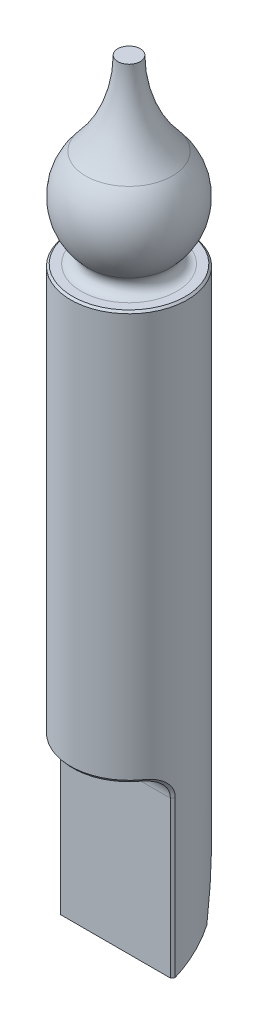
ISO-10303-21;
HEADER;
FILE_DESCRIPTION(('STEP AP214'),'2;1');
FILE_NAME('part.step','',(''),(''),'','','');
FILE_SCHEMA(('AUTOMOTIVE_DESIGN { 1 0 10303 214 1 1 1 1 }'));
ENDSEC;
DATA;
#1=APPLICATION_CONTEXT('core data for automotive mechanical design processes');
#2=APPLICATION_PROTOCOL_DEFINITION('international standard','automotive_design',2000,#1);
#3=PRODUCT_CONTEXT('',#1,'mechanical');
#4=PRODUCT('Part','Part','',(#3));
#5=PRODUCT_RELATED_PRODUCT_CATEGORY('part','',(#4));
#6=PRODUCT_DEFINITION_FORMATION('','',#4);
#7=PRODUCT_DEFINITION_CONTEXT('part definition',#1,'design');
#8=PRODUCT_DEFINITION('design','',#6,#7);
#9=PRODUCT_DEFINITION_SHAPE('','',#8);
#10=(LENGTH_UNIT() NAMED_UNIT(*) SI_UNIT(.MILLI.,.METRE.));
#11=(NAMED_UNIT(*) PLANE_ANGLE_UNIT() SI_UNIT($,.RADIAN.));
#12=(NAMED_UNIT(*) SI_UNIT($,.STERADIAN.) SOLID_ANGLE_UNIT());
#13=UNCERTAINTY_MEASURE_WITH_UNIT(LENGTH_MEASURE(1.E-05),#10,'distance_accuracy_value','');
#14=(GEOMETRIC_REPRESENTATION_CONTEXT(3) GLOBAL_UNCERTAINTY_ASSIGNED_CONTEXT((#13)) GLOBAL_UNIT_ASSIGNED_CONTEXT((#10,
#11,#12)) REPRESENTATION_CONTEXT('',''));
#15=CARTESIAN_POINT('',(0.,0.,0.));
#16=DIRECTION('',(0.,0.,1.));
#17=DIRECTION('',(1.,0.,0.));
#18=AXIS2_PLACEMENT_3D('',#15,#16,#17);
#19=CARTESIAN_POINT('',(-0.575,39.2822667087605,0.));
#20=DIRECTION('',(0.,-1.,0.));
#21=DIRECTION('',(0.,0.,-1.));
#22=AXIS2_PLACEMENT_3D('',#19,#20,#21);
#23=PLANE('',#22);
#24=CARTESIAN_POINT('',(0.,39.2822667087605,0.));
#25=DIRECTION('',(0.,-1.,0.));
#26=DIRECTION('',(0.,0.,-1.));
#27=AXIS2_PLACEMENT_3D('',#24,#25,#26);
#28=CIRCLE('',#27,0.575);
#29=CARTESIAN_POINT('',(0.,39.2822667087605,-0.575));
#30=VERTEX_POINT('',#29);
#31=EDGE_CURVE('E396',#30,#30,#28,.T.);
#32=ORIENTED_EDGE('',*,*,#31,.F.);
#33=EDGE_LOOP('',(#32));
#34=FACE_BOUND('',#33,.T.);
#35=ADVANCED_FACE('F35',(#34),#23,.F.);
#36=CARTESIAN_POINT('',(0.,39.2822667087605,0.));
#37=DIRECTION('',(0.,-1.,0.));
#38=DIRECTION('',(0.,0.,-1.));
#39=AXIS2_PLACEMENT_3D('',#36,#37,#38);
#40=TOROIDAL_SURFACE('',#39,6.925,6.35);
#41=CARTESIAN_POINT('',(0.,35.0157005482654,0.));
#42=DIRECTION('',(0.,-1.,0.));
#43=DIRECTION('',(0.,0.,-1.));
#44=AXIS2_PLACEMENT_3D('',#41,#42,#43);
#45=CIRCLE('',#44,2.22192513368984);
#46=CARTESIAN_POINT('',(-2.22192513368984,35.0157005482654,0.));
#47=VERTEX_POINT('',#46);
#48=EDGE_CURVE('E393',#47,#47,#45,.T.);
#49=ORIENTED_EDGE('',*,*,#48,.F.);
#50=EDGE_LOOP('',(#49));
#51=FACE_BOUND('',#50,.T.);
#52=ORIENTED_EDGE('',*,*,#31,.T.);
#53=EDGE_LOOP('',(#52));
#54=FACE_BOUND('',#53,.T.);
#55=ADVANCED_FACE('F540',(#51,#54),#40,.F.);
#56=CARTESIAN_POINT('',(0.,33.,0.));
#57=DIRECTION('',(0.,-1.,0.));
#58=DIRECTION('',(-1.,0.,0.));
#59=AXIS2_PLACEMENT_3D('',#56,#57,#58);
#60=SPHERICAL_SURFACE('',#59,3.);
#61=CARTESIAN_POINT('',(0.,30.8571428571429,0.));
#62=DIRECTION('',(0.,-1.,0.));
#63=DIRECTION('',(0.,0.,-1.));
#64=AXIS2_PLACEMENT_3D('',#61,#62,#63);
#65=CIRCLE('',#64,2.09956263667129);
#66=CARTESIAN_POINT('',(-2.0995626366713,30.8571428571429,0.));
#67=VERTEX_POINT('',#66);
#68=EDGE_CURVE('E389',#67,#67,#65,.T.);
#69=CARTESIAN_POINT('',(-2.0995626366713,30.8571428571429,0.));
#70=CARTESIAN_POINT('',(-2.1337681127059,30.8906559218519,0.));
#71=CARTESIAN_POINT('',(-2.16716980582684,30.9249892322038,0.));
#72=CARTESIAN_POINT('',(-2.23229208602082,30.9952148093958,0.));
#73=CARTESIAN_POINT('',(-2.26401267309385,31.0311070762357,0.));
#74=CARTESIAN_POINT('',(-2.32569920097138,31.1043690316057,0.));
#75=CARTESIAN_POINT('',(-2.35566514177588,31.1417387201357,0.));
#76=CARTESIAN_POINT('',(-2.41377389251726,31.2178696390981,0.));
#77=CARTESIAN_POINT('',(-2.44191670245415,31.2566308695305,0.));
#78=CARTESIAN_POINT('',(-2.49631461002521,31.3354560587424,0.));
#79=CARTESIAN_POINT('',(-2.52256970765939,31.3755200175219,0.));
#80=CARTESIAN_POINT('',(-2.57313201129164,31.4568587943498,0.));
#81=CARTESIAN_POINT('',(-2.5974392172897,31.4981336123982,0.));
#82=CARTESIAN_POINT('',(-2.64405000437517,31.581799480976,0.));
#83=CARTESIAN_POINT('',(-2.66635358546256,31.6241905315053,0.));
#84=CARTESIAN_POINT('',(-2.70890598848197,31.7099916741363,0.));
#85=CARTESIAN_POINT('',(-2.72915481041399,31.753401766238,0.));
#86=CARTESIAN_POINT('',(-2.76755127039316,31.8411414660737,0.));
#87=CARTESIAN_POINT('',(-2.78569890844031,31.8854710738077,0.));
#88=CARTESIAN_POINT('',(-2.81985139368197,31.9749481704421,0.));
#89=CARTESIAN_POINT('',(-2.83585624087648,32.0200956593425,0.));
#90=CARTESIAN_POINT('',(-2.86568645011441,32.1111050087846,0.));
#91=CARTESIAN_POINT('',(-2.87951181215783,32.1569668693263,0.));
#92=CARTESIAN_POINT('',(-2.90495135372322,32.2492998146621,0.));
#93=CARTESIAN_POINT('',(-2.9165655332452,32.2957708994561,0.));
#94=CARTESIAN_POINT('',(-2.93755608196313,32.3892157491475,0.));
#95=CARTESIAN_POINT('',(-2.94693245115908,32.4361895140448,0.));
#96=CARTESIAN_POINT('',(-2.96342588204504,32.5305320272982,0.));
#97=CARTESIAN_POINT('',(-2.97054294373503,32.5779007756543,0.));
#98=CARTESIAN_POINT('',(-2.98250144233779,32.6729246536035,0.));
#99=CARTESIAN_POINT('',(-2.98734287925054,32.7205797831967,0.));
#100=CARTESIAN_POINT('',(-2.99473902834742,32.8160671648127,0.));
#101=CARTESIAN_POINT('',(-2.99729374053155,32.8638994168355,0.));
#102=CARTESIAN_POINT('',(-3.00011058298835,32.9596313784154,0.));
#103=CARTESIAN_POINT('',(-3.00037271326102,33.0075310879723,0.));
#104=CARTESIAN_POINT('',(-2.99860379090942,33.1032881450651,0.));
#105=CARTESIAN_POINT('',(-2.99657273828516,33.1511454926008,0.));
#106=CARTESIAN_POINT('',(-2.99022210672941,33.2467081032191,0.));
#107=CARTESIAN_POINT('',(-2.98590252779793,33.2944133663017,0.));
#108=CARTESIAN_POINT('',(-2.97498474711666,33.3895624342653,0.));
#109=CARTESIAN_POINT('',(-2.96838654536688,33.4370062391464,0.));
#110=CARTESIAN_POINT('',(-2.95292664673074,33.5315236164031,0.));
#111=CARTESIAN_POINT('',(-2.94406494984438,33.5785971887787,0.));
#112=CARTESIAN_POINT('',(-2.92409837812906,33.6722661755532,0.));
#113=CARTESIAN_POINT('',(-2.91299350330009,33.7188615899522,0.));
#114=CARTESIAN_POINT('',(-2.88856603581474,33.8114674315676,0.));
#115=CARTESIAN_POINT('',(-2.87524344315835,33.8574778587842,0.));
#116=CARTESIAN_POINT('',(-2.84641108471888,33.9488082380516,0.));
#117=CARTESIAN_POINT('',(-2.83090131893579,33.9941281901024,0.));
#118=CARTESIAN_POINT('',(-2.79773017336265,34.0839737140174,0.));
#119=CARTESIAN_POINT('',(-2.7800687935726,34.1284992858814,0.));
#120=CARTESIAN_POINT('',(-2.74263491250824,34.2166539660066,0.));
#121=CARTESIAN_POINT('',(-2.72286241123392,34.2602830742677,0.));
#122=CARTESIAN_POINT('',(-2.68125161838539,34.3465447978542,0.));
#123=CARTESIAN_POINT('',(-2.65941332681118,34.3891774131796,0.));
#124=CARTESIAN_POINT('',(-2.61372102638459,34.4733484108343,0.));
#125=CARTESIAN_POINT('',(-2.58986701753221,34.5148867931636,0.));
#126=CARTESIAN_POINT('',(-2.54019795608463,34.5967740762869,0.));
#127=CARTESIAN_POINT('',(-2.51438290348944,34.6371229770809,0.));
#128=CARTESIAN_POINT('',(-2.46085100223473,34.7165388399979,0.));
#129=CARTESIAN_POINT('',(-2.43313415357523,34.7556058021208,0.));
#130=CARTESIAN_POINT('',(-2.37586197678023,34.8323680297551,0.));
#131=CARTESIAN_POINT('',(-2.34630664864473,34.8700632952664,0.));
#132=CARTESIAN_POINT('',(-2.28542613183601,34.9439964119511,0.));
#133=CARTESIAN_POINT('',(-2.25410094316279,34.9802342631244,0.));
#134=CARTESIAN_POINT('',(-2.22192513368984,35.0157005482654,0.));
#135=B_SPLINE_CURVE_WITH_KNOTS('',3,(#69,#70,#71,#72,#73,#74,#75,#76,#77,#78,#79,#80,#81,#82,
#83,#84,#85,#86,#87,#88,#89,#90,#91,#92,#93,#94,#95,#96,#97,#98,#99,#100,#101,#102,#103,#104,
#105,#106,#107,#108,#109,#110,#111,#112,#113,#114,#115,#116,#117,#118,#119,#120,#121,#122,#123,
#124,#125,#126,#127,#128,#129,#130,#131,#132,#133,#134),.UNSPECIFIED.,.F.,.F.,(4,2,2,2,2,2,2,2,
2,2,2,2,2,2,2,2,2,2,2,2,2,2,2,2,2,2,2,2,2,2,2,2,4),(0.,0.143646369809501,0.287292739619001,
0.430939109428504,0.574585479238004,0.718231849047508,0.86187821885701,1.00552458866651,
1.14917095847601,1.29281732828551,1.43646369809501,1.58011006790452,1.72375643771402,
1.86740280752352,2.01104917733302,2.15469554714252,2.29834191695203,2.44198828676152,
2.58563465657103,2.72928102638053,2.87292739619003,3.01657376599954,3.16022013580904,
3.30386650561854,3.44751287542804,3.59115924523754,3.73480561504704,3.87845198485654,
4.02209835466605,4.16574472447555,4.30939109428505,4.45303746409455,4.59668383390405),.UNSPECIFIED.);
#136=EDGE_CURVE('BSEAM545',#67,#47,#135,.T.);
#137=ORIENTED_EDGE('',*,*,#68,.F.);
#138=ORIENTED_EDGE('',*,*,#48,.T.);
#139=ORIENTED_EDGE('',*,*,#136,.T.);
#140=ORIENTED_EDGE('',*,*,#136,.F.);
#141=EDGE_LOOP('',(#137,#139,#138,#140));
#142=FACE_BOUND('',#141,.T.);
#143=ADVANCED_FACE('F545',(#142),#60,.T.);
#144=CARTESIAN_POINT('',(0.,30.5,0.));
#145=DIRECTION('',(0.,-1.,0.));
#146=DIRECTION('',(0.,0.,-1.));
#147=AXIS2_PLACEMENT_3D('',#144,#145,#146);
#148=TOROIDAL_SURFACE('',#147,2.44948974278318,0.500000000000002);
#149=CARTESIAN_POINT('',(0.,30.,0.));
#150=DIRECTION('',(0.,-1.,0.));
#151=DIRECTION('',(0.,0.,-1.));
#152=AXIS2_PLACEMENT_3D('',#149,#150,#151);
#153=CIRCLE('',#152,2.44948974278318);
#154=CARTESIAN_POINT('',(0.,30.,-2.44948974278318));
#155=VERTEX_POINT('',#154);
#156=EDGE_CURVE('E386',#155,#155,#153,.T.);
#157=ORIENTED_EDGE('',*,*,#156,.F.);
#158=EDGE_LOOP('',(#157));
#159=FACE_BOUND('',#158,.T.);
#160=ORIENTED_EDGE('',*,*,#68,.T.);
#161=EDGE_LOOP('',(#160));
#162=FACE_BOUND('',#161,.T.);
#163=ADVANCED_FACE('F552',(#159,#162),#148,.F.);
#164=CARTESIAN_POINT('',(-3.,30.,0.));
#165=DIRECTION('',(0.,-1.,0.));
#166=DIRECTION('',(0.,0.,-1.));
#167=AXIS2_PLACEMENT_3D('',#164,#165,#166);
#168=PLANE('',#167);
#169=CARTESIAN_POINT('',(0.,30.,0.));
#170=DIRECTION('',(0.,-1.,0.));
#171=DIRECTION('',(0.,0.,-1.));
#172=AXIS2_PLACEMENT_3D('',#169,#170,#171);
#173=CIRCLE('',#172,2.89999999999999);
#174=CARTESIAN_POINT('',(0.,30.,-2.89999999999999));
#175=VERTEX_POINT('',#174);
#176=EDGE_CURVE('E12',#175,#175,#173,.F.);
#177=ORIENTED_EDGE('',*,*,#176,.T.);
#178=EDGE_LOOP('',(#177));
#179=FACE_BOUND('',#178,.T.);
#180=ORIENTED_EDGE('',*,*,#156,.T.);
#181=EDGE_LOOP('',(#180));
#182=FACE_BOUND('',#181,.T.);
#183=ADVANCED_FACE('F431',(#179,#182),#168,.F.);
#184=CARTESIAN_POINT('',(0.,0.,0.));
#185=DIRECTION('',(0.,-1.,0.));
#186=DIRECTION('',(0.,0.,-1.));
#187=AXIS2_PLACEMENT_3D('',#184,#185,#186);
#188=CYLINDRICAL_SURFACE('',#187,3.);
#189=CARTESIAN_POINT('',(0.,-3.41221308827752,0.));
#190=DIRECTION('',(0.,0.262189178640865,0.965016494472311));
#191=DIRECTION('',(0.,-0.965016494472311,0.262189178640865));
#192=AXIS2_PLACEMENT_3D('',#189,#190,#191);
#193=ELLIPSE('',#192,11.4421198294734,3.);
#194=CARTESIAN_POINT('',(2.71212837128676,1.30753028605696,-1.28232589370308));
#195=VERTEX_POINT('',#194);
#196=CARTESIAN_POINT('',(-2.71212837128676,1.30753028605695,-1.28232589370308));
#197=VERTEX_POINT('',#196);
#198=EDGE_CURVE('E118',#195,#197,#193,.T.);
#199=ORIENTED_EDGE('',*,*,#198,.T.);
#200=CARTESIAN_POINT('',(-2.91694338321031,-0.0653847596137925,0.701028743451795));
#201=CARTESIAN_POINT('',(-3.08504908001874,0.412433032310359,0.0107565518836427));
#202=CARTESIAN_POINT('',(-2.9955008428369,0.930722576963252,-0.737982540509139));
#203=CARTESIAN_POINT('',(-2.66935352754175,1.3676220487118,-1.36914270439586));
#204=B_SPLINE_CURVE_WITH_KNOTS('',3,(#200,#201,#202,#203),.UNSPECIFIED.,.F.,.F.,(4,4),
(4.23846543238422,4.94824588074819),.UNSPECIFIED.);
#205=CARTESIAN_POINT('',(-2.93814835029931,0.0118301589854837,0.579042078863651));
#206=VERTEX_POINT('',#205);
#207=EDGE_CURVE('E126',#197,#206,#204,.F.);
#208=ORIENTED_EDGE('',*,*,#207,.T.);
#209=DIRECTION('',(0.,-1.,0.));
#210=VECTOR('',#209,1.);
#211=CARTESIAN_POINT('',(-2.9449100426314,0.,0.572280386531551));
#212=LINE('',#211,#210);
#213=CARTESIAN_POINT('',(-2.9449100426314,8.,0.572280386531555));
#214=VERTEX_POINT('',#213);
#215=EDGE_CURVE('E127',#206,#214,#212,.F.);
#216=ORIENTED_EDGE('',*,*,#215,.T.);
#217=CARTESIAN_POINT('',(-2.41702691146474,9.15253919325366,1.77707087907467));
#218=CARTESIAN_POINT('',(-2.8330422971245,9.19197157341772,1.23380111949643));
#219=CARTESIAN_POINT('',(-2.95387614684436,8.6679028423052,0.546867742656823));
#220=CARTESIAN_POINT('',(-2.9449100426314,8.,0.572280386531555));
#221=B_SPLINE_CURVE_WITH_KNOTS('',3,(#217,#218,#219,#220),.UNSPECIFIED.,.F.,.F.,(4,4),(0.,
0.00190616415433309),.UNSPECIFIED.);
#222=CARTESIAN_POINT('',(-2.41702691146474,9.15253919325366,1.77707087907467));
#223=VERTEX_POINT('',#222);
#224=EDGE_CURVE('E283',#214,#223,#221,.F.);
#225=ORIENTED_EDGE('',*,*,#224,.T.);
#226=CARTESIAN_POINT('',(0.,9.15253919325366,0.));
#227=DIRECTION('',(0.,1.,0.));
#228=DIRECTION('',(0.,0.,1.));
#229=AXIS2_PLACEMENT_3D('',#226,#227,#228);
#230=CIRCLE('',#229,3.);
#231=CARTESIAN_POINT('',(2.41702691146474,9.15253919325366,1.77707087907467));
#232=VERTEX_POINT('',#231);
#233=EDGE_CURVE('E300',#223,#232,#230,.T.);
#234=ORIENTED_EDGE('',*,*,#233,.T.);
#235=CARTESIAN_POINT('',(2.9449100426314,8.,0.572280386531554));
#236=CARTESIAN_POINT('',(2.95358423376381,8.67201574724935,0.54857324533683));
#237=CARTESIAN_POINT('',(2.83230342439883,9.19113963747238,1.23508206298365));
#238=CARTESIAN_POINT('',(2.41702691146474,9.15253919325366,1.77707087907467));
#239=B_SPLINE_CURVE_WITH_KNOTS('',3,(#235,#236,#237,#238),.UNSPECIFIED.,.F.,.F.,(4,4),(0.,
0.00190531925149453),.UNSPECIFIED.);
#240=CARTESIAN_POINT('',(2.9449100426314,8.,0.572280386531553));
#241=VERTEX_POINT('',#240);
#242=EDGE_CURVE('E204',#232,#241,#239,.F.);
#243=ORIENTED_EDGE('',*,*,#242,.T.);
#244=DIRECTION('',(0.,-1.,0.));
#245=VECTOR('',#244,1.);
#246=CARTESIAN_POINT('',(2.9449100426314,0.,0.572280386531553));
#247=LINE('',#246,#245);
#248=CARTESIAN_POINT('',(2.93812874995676,0.0117965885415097,0.579061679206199));
#249=VERTEX_POINT('',#248);
#250=EDGE_CURVE('E121',#241,#249,#247,.T.);
#251=ORIENTED_EDGE('',*,*,#250,.T.);
#252=CARTESIAN_POINT('',(2.66935352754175,1.3676220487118,-1.36914270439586));
#253=CARTESIAN_POINT('',(2.9955008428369,0.930722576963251,-0.737982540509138));
#254=CARTESIAN_POINT('',(3.08504908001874,0.412433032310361,0.0107565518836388));
#255=CARTESIAN_POINT('',(2.91694338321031,-0.0653847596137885,0.701028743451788));
#256=B_SPLINE_CURVE_WITH_KNOTS('',3,(#252,#253,#254,#255),.UNSPECIFIED.,.F.,.F.,(4,4),
(1.3349394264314,2.04471987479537),.UNSPECIFIED.);
#257=EDGE_CURVE('E112',#249,#195,#256,.F.);
#258=ORIENTED_EDGE('',*,*,#257,.T.);
#259=EDGE_LOOP('',(#199,#208,#216,#225,#234,#243,#251,#258));
#260=FACE_BOUND('',#259,.T.);
#261=CARTESIAN_POINT('',(0.,29.9,0.));
#262=DIRECTION('',(0.,-1.,0.));
#263=DIRECTION('',(0.,0.,-1.));
#264=AXIS2_PLACEMENT_3D('',#261,#262,#263);
#265=CIRCLE('',#264,3.);
#266=CARTESIAN_POINT('',(0.,29.9,-3.));
#267=VERTEX_POINT('',#266);
#268=EDGE_CURVE('E139',#267,#267,#265,.T.);
#269=ORIENTED_EDGE('',*,*,#268,.T.);
#270=EDGE_LOOP('',(#269));
#271=FACE_BOUND('',#270,.T.);
#272=ADVANCED_FACE('F115',(#260,#271),#188,.T.);
#273=CARTESIAN_POINT('',(-3.,0.,0.));
#274=DIRECTION('',(0.,1.,0.));
#275=DIRECTION('',(0.,0.,1.));
#276=AXIS2_PLACEMENT_3D('',#273,#274,#275);
#277=PLANE('',#276);
#278=DIRECTION('',(-0.707106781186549,0.,-0.707106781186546));
#279=VECTOR('',#278,1.);
#280=CARTESIAN_POINT('',(-2.9449100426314,0.,0.572280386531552));
#281=LINE('',#280,#279);
#282=CARTESIAN_POINT('',(-2.81719042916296,0.,0.699999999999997));
#283=VERTEX_POINT('',#282);
#284=EDGE_CURVE('E364',#283,#206,#281,.T.);
#285=ORIENTED_EDGE('',*,*,#284,.T.);
#286=CARTESIAN_POINT('',(-2.85513282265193,0.,0.380028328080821));
#287=CARTESIAN_POINT('',(-2.85845350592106,-1.35360299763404E-05,0.388461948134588));
#288=CARTESIAN_POINT('',(-2.86175195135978,-2.55020193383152E-05,0.396904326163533));
#289=CARTESIAN_POINT('',(-2.86831316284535,-4.62415559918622E-05,0.413829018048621));
#290=CARTESIAN_POINT('',(-2.87157580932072,-5.50064457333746E-05,0.422311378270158));
#291=CARTESIAN_POINT('',(-2.87806503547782,-6.92368155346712E-05,0.439315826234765));
#292=CARTESIAN_POINT('',(-2.88129149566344,-7.46934275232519E-05,0.447837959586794));
#293=CARTESIAN_POINT('',(-2.88770796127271,-8.22006078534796E-05,0.464921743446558));
#294=CARTESIAN_POINT('',(-2.890897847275,-8.42421017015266E-05,0.47348343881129));
#295=CARTESIAN_POINT('',(-2.89724077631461,-8.48123125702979E-05,0.490646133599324));
#296=CARTESIAN_POINT('',(-2.90039370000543,-8.33317515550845E-05,0.499247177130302));
#297=CARTESIAN_POINT('',(-2.9066623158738,-7.67511625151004E-05,0.516488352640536));
#298=CARTESIAN_POINT('',(-2.90977788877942,-7.16416561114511E-05,0.525128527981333));
#299=CARTESIAN_POINT('',(-2.91597141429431,-5.76963946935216E-05,0.542447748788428));
#300=CARTESIAN_POINT('',(-2.91904924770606,-4.88509637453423E-05,0.551126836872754));
#301=CARTESIAN_POINT('',(-2.92516690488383,-2.73273770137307E-05,0.568523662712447));
#302=CARTESIAN_POINT('',(-2.92820660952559,-1.46393515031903E-05,0.577241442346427));
#303=CARTESIAN_POINT('',(-2.93122323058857,0.,0.585967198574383));
#304=B_SPLINE_CURVE_WITH_KNOTS('',3,(#286,#287,#288,#289,#290,#291,#292,#293,#294,#295,#296,
#297,#298,#299,#300,#301,#302,#303),.UNSPECIFIED.,.F.,.F.,(4,2,2,2,2,2,2,2,4),(0.,
0.0271914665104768,0.0544559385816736,0.0817931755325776,0.109202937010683,0.136684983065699,
0.164239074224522,0.191864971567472,0.219562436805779),.UNSPECIFIED.);
#305=CARTESIAN_POINT('',(-2.85512163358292,0.,0.379999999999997));
#306=VERTEX_POINT('',#305);
#307=EDGE_CURVE('E358',#206,#306,#304,.F.);
#308=ORIENTED_EDGE('',*,*,#307,.T.);
#309=DIRECTION('',(1.,0.,0.));
#310=VECTOR('',#309,1.);
#311=CARTESIAN_POINT('',(-3.,0.,0.379999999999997));
#312=LINE('',#311,#310);
#313=CARTESIAN_POINT('',(2.85512163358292,0.,0.379999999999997));
#314=VERTEX_POINT('',#313);
#315=EDGE_CURVE('E399',#306,#314,#312,.T.);
#316=ORIENTED_EDGE('',*,*,#315,.T.);
#317=CARTESIAN_POINT('',(2.93122323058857,0.,0.585967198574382));
#318=CARTESIAN_POINT('',(2.92820660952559,-1.46393515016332E-05,0.577241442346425));
#319=CARTESIAN_POINT('',(2.92516690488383,-2.73273770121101E-05,0.568523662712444));
#320=CARTESIAN_POINT('',(2.91904924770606,-4.88509637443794E-05,0.551126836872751));
#321=CARTESIAN_POINT('',(2.91597141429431,-5.7696394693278E-05,0.542447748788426));
#322=CARTESIAN_POINT('',(2.90977788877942,-7.1641656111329E-05,0.525128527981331));
#323=CARTESIAN_POINT('',(2.90666231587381,-7.67511625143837E-05,0.516488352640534));
#324=CARTESIAN_POINT('',(2.90039370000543,-8.33317515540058E-05,0.499247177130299));
#325=CARTESIAN_POINT('',(2.89724077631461,-8.48123125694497E-05,0.490646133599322));
#326=CARTESIAN_POINT('',(2.89089784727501,-8.42421017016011E-05,0.473483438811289));
#327=CARTESIAN_POINT('',(2.88770796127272,-8.2200607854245E-05,0.464921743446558));
#328=CARTESIAN_POINT('',(2.88129149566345,-7.46934275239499E-05,0.447837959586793));
#329=CARTESIAN_POINT('',(2.87806503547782,-6.92368155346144E-05,0.439315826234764));
#330=CARTESIAN_POINT('',(2.87157580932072,-5.50064457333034E-05,0.422311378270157));
#331=CARTESIAN_POINT('',(2.86831316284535,-4.62415559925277E-05,0.413829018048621));
#332=CARTESIAN_POINT('',(2.86175195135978,-2.55020193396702E-05,0.396904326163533));
#333=CARTESIAN_POINT('',(2.85845350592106,-1.35360299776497E-05,0.388461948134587));
#334=CARTESIAN_POINT('',(2.85513282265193,0.,0.38002832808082));
#335=B_SPLINE_CURVE_WITH_KNOTS('',3,(#317,#318,#319,#320,#321,#322,#323,#324,#325,#326,#327,
#328,#329,#330,#331,#332,#333,#334),.UNSPECIFIED.,.F.,.F.,(4,2,2,2,2,2,2,2,4),(0.,
0.027697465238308,0.0553233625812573,0.0828774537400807,0.110359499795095,0.137769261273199,
0.165106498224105,0.1923709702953,0.219562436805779),.UNSPECIFIED.);
#336=EDGE_CURVE('E190',#314,#249,#335,.F.);
#337=ORIENTED_EDGE('',*,*,#336,.T.);
#338=DIRECTION('',(0.707106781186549,0.,-0.707106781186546));
#339=VECTOR('',#338,1.);
#340=CARTESIAN_POINT('',(2.9449100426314,0.,0.572280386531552));
#341=LINE('',#340,#339);
#342=CARTESIAN_POINT('',(2.81719042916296,0.,0.699999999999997));
#343=VERTEX_POINT('',#342);
#344=EDGE_CURVE('E369',#249,#343,#341,.F.);
#345=ORIENTED_EDGE('',*,*,#344,.T.);
#346=DIRECTION('',(-1.,0.,0.));
#347=VECTOR('',#346,1.);
#348=CARTESIAN_POINT('',(-3.,0.,0.699999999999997));
#349=LINE('',#348,#347);
#350=EDGE_CURVE('E140',#343,#283,#349,.T.);
#351=ORIENTED_EDGE('',*,*,#350,.T.);
#352=EDGE_LOOP('',(#285,#308,#316,#337,#345,#351));
#353=FACE_BOUND('',#352,.T.);
#354=ADVANCED_FACE('F415',(#353),#277,.F.);
#355=CARTESIAN_POINT('',(-5.,0.,0.379999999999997));
#356=DIRECTION('',(0.,0.812083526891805,0.583541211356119));
#357=DIRECTION('',(0.,-0.583541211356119,0.812083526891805));
#358=AXIS2_PLACEMENT_3D('',#355,#356,#357);
#359=PLANE('',#358);
#360=ORIENTED_EDGE('',*,*,#315,.F.);
#361=CARTESIAN_POINT('',(-2.57144478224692,1.27079645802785,-1.38850040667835));
#362=CARTESIAN_POINT('',(-2.88562939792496,0.833896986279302,-0.780490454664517));
#363=CARTESIAN_POINT('',(-2.97189311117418,0.315607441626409,-0.0592142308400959));
#364=CARTESIAN_POINT('',(-2.80995333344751,-0.162210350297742,0.605739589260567));
#365=B_SPLINE_CURVE_WITH_KNOTS('',3,(#361,#362,#363,#364),.UNSPECIFIED.,.F.,.F.,(4,4),
(4.23846543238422,4.94824588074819),.UNSPECIFIED.);
#366=CARTESIAN_POINT('',(-2.64082652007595,1.16708242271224,-1.24416705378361));
#367=VERTEX_POINT('',#366);
#368=EDGE_CURVE('E147',#306,#367,#365,.F.);
#369=ORIENTED_EDGE('',*,*,#368,.T.);
#370=DIRECTION('',(1.,0.,0.));
#371=VECTOR('',#370,1.);
#372=CARTESIAN_POINT('',(-5.,1.16708242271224,-1.24416705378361));
#373=LINE('',#372,#371);
#374=CARTESIAN_POINT('',(2.64082652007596,1.16708242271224,-1.24416705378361));
#375=VERTEX_POINT('',#374);
#376=EDGE_CURVE('E377',#367,#375,#373,.T.);
#377=ORIENTED_EDGE('',*,*,#376,.T.);
#378=CARTESIAN_POINT('',(2.80995333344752,-0.162210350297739,0.605739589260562));
#379=CARTESIAN_POINT('',(2.97189311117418,0.315607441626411,-0.0592142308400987));
#380=CARTESIAN_POINT('',(2.88562939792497,0.833896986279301,-0.780490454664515));
#381=CARTESIAN_POINT('',(2.57144478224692,1.27079645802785,-1.38850040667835));
#382=B_SPLINE_CURVE_WITH_KNOTS('',3,(#378,#379,#380,#381),.UNSPECIFIED.,.F.,.F.,(4,4),
(1.3349394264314,2.04471987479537),.UNSPECIFIED.);
#383=EDGE_CURVE('E145',#375,#314,#382,.F.);
#384=ORIENTED_EDGE('',*,*,#383,.T.);
#385=EDGE_LOOP('',(#360,#369,#377,#384));
#386=FACE_BOUND('',#385,.T.);
#387=ADVANCED_FACE('F424',(#386),#359,.F.);
#388=CARTESIAN_POINT('',(-5.,1.16708242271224,-1.24416705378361));
#389=DIRECTION('',(0.,0.262189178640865,0.965016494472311));
#390=DIRECTION('',(0.,-0.965016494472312,0.262189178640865));
#391=AXIS2_PLACEMENT_3D('',#388,#389,#390);
#392=PLANE('',#391);
#393=ORIENTED_EDGE('',*,*,#376,.F.);
#394=CARTESIAN_POINT('',(-2.71237030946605,1.3075362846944,-1.28234072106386));
#395=CARTESIAN_POINT('',(-2.70946499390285,1.30169360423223,-1.28066804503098));
#396=CARTESIAN_POINT('',(-2.70655122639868,1.29585202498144,-1.27900620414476));
#397=CARTESIAN_POINT('',(-2.70070457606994,1.28416636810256,-1.27570288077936));
#398=CARTESIAN_POINT('',(-2.69777167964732,1.27832229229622,-1.27406141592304));
#399=CARTESIAN_POINT('',(-2.69188687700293,1.2666316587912,-1.27079891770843));
#400=CARTESIAN_POINT('',(-2.68893495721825,1.26078510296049,-1.2691779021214));
#401=CARTESIAN_POINT('',(-2.68301221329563,1.24908952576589,-1.26595637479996));
#402=CARTESIAN_POINT('',(-2.68004137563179,1.24324050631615,-1.26435588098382));
#403=CARTESIAN_POINT('',(-2.67408090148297,1.23154001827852,-1.26117546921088));
#404=CARTESIAN_POINT('',(-2.67109125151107,1.22568855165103,-1.25959556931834));
#405=CARTESIAN_POINT('',(-2.66509325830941,1.21398318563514,-1.25645641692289));
#406=CARTESIAN_POINT('',(-2.66208490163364,1.2081292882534,-1.25489718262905));
#407=CARTESIAN_POINT('',(-2.65604960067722,1.19641907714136,-1.2517994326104));
#408=CARTESIAN_POINT('',(-2.65302264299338,1.19056276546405,-1.25026093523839));
#409=CARTESIAN_POINT('',(-2.64695024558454,1.17884774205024,-1.24720472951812));
#410=CARTESIAN_POINT('',(-2.64390479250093,1.17298903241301,-1.24568703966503));
#411=CARTESIAN_POINT('',(-2.64085143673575,1.16713159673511,-1.24418041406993));
#412=B_SPLINE_CURVE_WITH_KNOTS('',3,(#394,#395,#396,#397,#398,#399,#400,#401,#402,#403,#404,
#405,#406,#407,#408,#409,#410,#411),.UNSPECIFIED.,.F.,.F.,(4,2,2,2,2,2,2,2,4),(0.,
0.0202084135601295,0.0404332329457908,0.0606745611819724,0.0809325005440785,0.101207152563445,
0.121498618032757,0.141806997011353,0.162132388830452),.UNSPECIFIED.);
#413=EDGE_CURVE('E137',#367,#197,#412,.F.);
#414=ORIENTED_EDGE('',*,*,#413,.T.);
#415=ORIENTED_EDGE('',*,*,#198,.F.);
#416=CARTESIAN_POINT('',(2.64085143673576,1.16713159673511,-1.24418041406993));
#417=CARTESIAN_POINT('',(2.64390479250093,1.17298903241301,-1.24568703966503));
#418=CARTESIAN_POINT('',(2.64695024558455,1.17884774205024,-1.24720472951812));
#419=CARTESIAN_POINT('',(2.65302264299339,1.19056276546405,-1.25026093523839));
#420=CARTESIAN_POINT('',(2.65604960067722,1.19641907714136,-1.2517994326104));
#421=CARTESIAN_POINT('',(2.66208490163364,1.2081292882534,-1.25489718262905));
#422=CARTESIAN_POINT('',(2.66509325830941,1.21398318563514,-1.25645641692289));
#423=CARTESIAN_POINT('',(2.67109125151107,1.22568855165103,-1.25959556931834));
#424=CARTESIAN_POINT('',(2.67408090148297,1.23154001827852,-1.26117546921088));
#425=CARTESIAN_POINT('',(2.6800413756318,1.24324050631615,-1.26435588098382));
#426=CARTESIAN_POINT('',(2.68301221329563,1.24908952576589,-1.26595637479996));
#427=CARTESIAN_POINT('',(2.68893495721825,1.26078510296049,-1.2691779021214));
#428=CARTESIAN_POINT('',(2.69188687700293,1.2666316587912,-1.27079891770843));
#429=CARTESIAN_POINT('',(2.69777167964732,1.27832229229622,-1.27406141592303));
#430=CARTESIAN_POINT('',(2.70070457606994,1.28416636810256,-1.27570288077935));
#431=CARTESIAN_POINT('',(2.70655122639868,1.29585202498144,-1.27900620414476));
#432=CARTESIAN_POINT('',(2.70946499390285,1.30169360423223,-1.28066804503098));
#433=CARTESIAN_POINT('',(2.71237030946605,1.3075362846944,-1.28234072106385));
#434=B_SPLINE_CURVE_WITH_KNOTS('',3,(#416,#417,#418,#419,#420,#421,#422,#423,#424,#425,#426,
#427,#428,#429,#430,#431,#432,#433),.UNSPECIFIED.,.F.,.F.,(4,2,2,2,2,2,2,2,4),(0.,
0.0203253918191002,0.0406337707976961,0.060925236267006,0.0811998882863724,0.101457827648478,
0.121699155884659,0.14192397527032,0.162132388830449),.UNSPECIFIED.);
#435=EDGE_CURVE('E133',#195,#375,#434,.F.);
#436=ORIENTED_EDGE('',*,*,#435,.T.);
#437=EDGE_LOOP('',(#393,#414,#415,#436));
#438=FACE_BOUND('',#437,.T.);
#439=ADVANCED_FACE('F132',(#438),#392,.F.);
#440=CARTESIAN_POINT('',(-5.,9.,3.));
#441=DIRECTION('',(0.,1.,0.));
#442=DIRECTION('',(0.,0.,1.));
#443=AXIS2_PLACEMENT_3D('',#440,#441,#442);
#444=PLANE('',#443);
#445=DIRECTION('',(1.,0.,0.));
#446=VECTOR('',#445,1.);
#447=CARTESIAN_POINT('',(-5.,9.,1.7));
#448=LINE('',#447,#446);
#449=CARTESIAN_POINT('',(-2.31220138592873,9.,1.7));
#450=VERTEX_POINT('',#449);
#451=CARTESIAN_POINT('',(2.31220138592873,9.,1.7));
#452=VERTEX_POINT('',#451);
#453=EDGE_CURVE('E390',#450,#452,#448,.T.);
#454=ORIENTED_EDGE('',*,*,#453,.T.);
#455=CARTESIAN_POINT('',(0.,9.,0.));
#456=DIRECTION('',(0.,1.,0.));
#457=DIRECTION('',(0.,0.,1.));
#458=AXIS2_PLACEMENT_3D('',#455,#456,#457);
#459=CIRCLE('',#458,2.86989115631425);
#460=EDGE_CURVE('E46',#452,#450,#459,.F.);
#461=ORIENTED_EDGE('',*,*,#460,.T.);
#462=EDGE_LOOP('',(#454,#461));
#463=FACE_BOUND('',#462,.T.);
#464=ADVANCED_FACE('F489',(#463),#444,.F.);
#465=CARTESIAN_POINT('',(-5.,8.,1.7));
#466=DIRECTION('',(1.,0.,0.));
#467=DIRECTION('',(0.,0.,-1.));
#468=AXIS2_PLACEMENT_3D('',#465,#466,#467);
#469=CYLINDRICAL_SURFACE('',#468,1.);
#470=ORIENTED_EDGE('',*,*,#453,.F.);
#471=CARTESIAN_POINT('',(-2.81719042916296,8.,0.699999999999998));
#472=CARTESIAN_POINT('',(-2.82576767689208,8.5795055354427,0.67890700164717));
#473=CARTESIAN_POINT('',(-2.71017434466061,9.03421348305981,1.24907532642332));
#474=CARTESIAN_POINT('',(-2.31220138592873,9.,1.7));
#475=B_SPLINE_CURVE_WITH_KNOTS('',3,(#471,#472,#473,#474),.UNSPECIFIED.,.F.,.F.,(4,4),(0.,
0.00190616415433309),.UNSPECIFIED.);
#476=CARTESIAN_POINT('',(-2.81719042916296,8.,0.699999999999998));
#477=VERTEX_POINT('',#476);
#478=EDGE_CURVE('E500',#450,#477,#475,.F.);
#479=ORIENTED_EDGE('',*,*,#478,.T.);
#480=DIRECTION('',(1.,0.,0.));
#481=VECTOR('',#480,1.);
#482=CARTESIAN_POINT('',(-5.,8.,0.699999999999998));
#483=LINE('',#482,#481);
#484=CARTESIAN_POINT('',(2.81719042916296,8.,0.699999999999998));
#485=VERTEX_POINT('',#484);
#486=EDGE_CURVE('E379',#477,#485,#483,.T.);
#487=ORIENTED_EDGE('',*,*,#486,.T.);
#488=CARTESIAN_POINT('',(2.31220138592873,9.,1.7));
#489=CARTESIAN_POINT('',(2.70946751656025,9.03349165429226,1.25013853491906));
#490=CARTESIAN_POINT('',(2.82548842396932,8.58307409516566,0.680322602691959));
#491=CARTESIAN_POINT('',(2.81719042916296,8.,0.699999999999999));
#492=B_SPLINE_CURVE_WITH_KNOTS('',3,(#488,#489,#490,#491),.UNSPECIFIED.,.F.,.F.,(4,4),(0.,
0.00190531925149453),.UNSPECIFIED.);
#493=EDGE_CURVE('E54',#485,#452,#492,.F.);
#494=ORIENTED_EDGE('',*,*,#493,.T.);
#495=EDGE_LOOP('',(#470,#479,#487,#494));
#496=FACE_BOUND('',#495,.T.);
#497=ADVANCED_FACE('F479',(#496),#469,.F.);
#498=CARTESIAN_POINT('',(-5.,8.,0.699999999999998));
#499=DIRECTION('',(0.,0.,-1.));
#500=DIRECTION('',(0.,1.,0.));
#501=AXIS2_PLACEMENT_3D('',#498,#499,#500);
#502=PLANE('',#501);
#503=ORIENTED_EDGE('',*,*,#486,.F.);
#504=DIRECTION('',(0.,-1.,0.));
#505=VECTOR('',#504,1.);
#506=CARTESIAN_POINT('',(-2.81719042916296,8.,0.699999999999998));
#507=LINE('',#506,#505);
#508=EDGE_CURVE('E306',#477,#283,#507,.T.);
#509=ORIENTED_EDGE('',*,*,#508,.T.);
#510=ORIENTED_EDGE('',*,*,#350,.F.);
#511=DIRECTION('',(0.,1.,0.));
#512=VECTOR('',#511,1.);
#513=CARTESIAN_POINT('',(2.81719042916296,8.,0.699999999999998));
#514=LINE('',#513,#512);
#515=EDGE_CURVE('E462',#343,#485,#514,.T.);
#516=ORIENTED_EDGE('',*,*,#515,.T.);
#517=EDGE_LOOP('',(#503,#509,#510,#516));
#518=FACE_BOUND('',#517,.T.);
#519=ADVANCED_FACE('F165',(#518),#502,.F.);
#520=CARTESIAN_POINT('',(2.91694338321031,-0.0653847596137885,0.701028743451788));
#521=CARTESIAN_POINT('',(3.08504908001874,0.412433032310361,0.0107565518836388));
#522=CARTESIAN_POINT('',(2.9955008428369,0.930722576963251,-0.737982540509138));
#523=CARTESIAN_POINT('',(2.66935352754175,1.3676220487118,-1.36914270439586));
#524=CARTESIAN_POINT('',(2.80995333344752,-0.162210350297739,0.605739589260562));
#525=CARTESIAN_POINT('',(2.97189311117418,0.315607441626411,-0.0592142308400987));
#526=CARTESIAN_POINT('',(2.88562939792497,0.833896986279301,-0.780490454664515));
#527=CARTESIAN_POINT('',(2.57144478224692,1.27079645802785,-1.38850040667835));
#528=B_SPLINE_SURFACE_WITH_KNOTS('',1,3,((#520,#521,#522,#523),(#524,#525,#526,#527)),
.UNSPECIFIED.,.F.,.F.,.F.,(2,2),(4,4),(0.,1.),(1.3349394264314,2.04471987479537),.UNSPECIFIED.);
#529=ORIENTED_EDGE('',*,*,#435,.F.);
#530=ORIENTED_EDGE('',*,*,#257,.F.);
#531=ORIENTED_EDGE('',*,*,#336,.F.);
#532=ORIENTED_EDGE('',*,*,#383,.F.);
#533=EDGE_LOOP('',(#529,#530,#531,#532));
#534=FACE_BOUND('',#533,.T.);
#535=ADVANCED_FACE('F144',(#534),#528,.T.);
#536=CARTESIAN_POINT('',(2.9449100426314,0.,0.572280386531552));
#537=DIRECTION('',(-0.707106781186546,0.,-0.707106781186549));
#538=DIRECTION('',(-0.707106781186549,0.,0.707106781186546));
#539=AXIS2_PLACEMENT_3D('',#536,#537,#538);
#540=PLANE('',#539);
#541=ORIENTED_EDGE('',*,*,#344,.F.);
#542=ORIENTED_EDGE('',*,*,#250,.F.);
#543=CARTESIAN_POINT('',(2.81719042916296,8.,0.699999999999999));
#544=CARTESIAN_POINT('',(2.9449100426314,8.,0.572280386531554));
#545=B_SPLINE_CURVE_WITH_KNOTS('',1,(#543,#544),.UNSPECIFIED.,.F.,.F.,(2,2),(0.,1.),.UNSPECIFIED.);
#546=EDGE_CURVE('E218',#485,#241,#545,.T.);
#547=ORIENTED_EDGE('',*,*,#546,.F.);
#548=ORIENTED_EDGE('',*,*,#515,.F.);
#549=EDGE_LOOP('',(#541,#542,#547,#548));
#550=FACE_BOUND('',#549,.T.);
#551=ADVANCED_FACE('F164',(#550),#540,.F.);
#552=CARTESIAN_POINT('',(2.41702691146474,9.15253919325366,1.77707087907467));
#553=CARTESIAN_POINT('',(2.83230342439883,9.19113963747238,1.23508206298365));
#554=CARTESIAN_POINT('',(2.95358423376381,8.67201574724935,0.54857324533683));
#555=CARTESIAN_POINT('',(2.9449100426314,8.,0.572280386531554));
#556=CARTESIAN_POINT('',(2.31220138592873,9.,1.7));
#557=CARTESIAN_POINT('',(2.70946751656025,9.03349165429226,1.25013853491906));
#558=CARTESIAN_POINT('',(2.82548842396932,8.58307409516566,0.680322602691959));
#559=CARTESIAN_POINT('',(2.81719042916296,8.,0.699999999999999));
#560=B_SPLINE_SURFACE_WITH_KNOTS('',1,3,((#552,#553,#554,#555),(#556,#557,#558,#559)),
.UNSPECIFIED.,.F.,.F.,.F.,(2,2),(4,4),(0.,1.),(0.,0.00190531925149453),.UNSPECIFIED.);
#561=CARTESIAN_POINT('',(2.41702691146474,9.15253919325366,1.77707087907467));
#562=CARTESIAN_POINT('',(2.31220138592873,9.,1.7));
#563=B_SPLINE_CURVE_WITH_KNOTS('',1,(#561,#562),.UNSPECIFIED.,.F.,.F.,(2,2),(0.,1.),.UNSPECIFIED.);
#564=EDGE_CURVE('E246',#452,#232,#563,.F.);
#565=ORIENTED_EDGE('',*,*,#546,.T.);
#566=ORIENTED_EDGE('',*,*,#242,.F.);
#567=ORIENTED_EDGE('',*,*,#564,.F.);
#568=ORIENTED_EDGE('',*,*,#493,.F.);
#569=EDGE_LOOP('',(#565,#566,#567,#568));
#570=FACE_BOUND('',#569,.T.);
#571=ADVANCED_FACE('F166',(#570),#560,.T.);
#572=CARTESIAN_POINT('',(0.,9.15253919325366,0.));
#573=DIRECTION('',(0.,1.,0.));
#574=DIRECTION('',(0.,0.,1.));
#575=AXIS2_PLACEMENT_3D('',#572,#573,#574);
#576=CONICAL_SURFACE('',#575,3.,0.70620624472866);
#577=ORIENTED_EDGE('',*,*,#564,.T.);
#578=ORIENTED_EDGE('',*,*,#233,.F.);
#579=CARTESIAN_POINT('',(-2.31220138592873,9.,1.7));
#580=CARTESIAN_POINT('',(-2.41702691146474,9.15253919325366,1.77707087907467));
#581=B_SPLINE_CURVE_WITH_KNOTS('',1,(#579,#580),.UNSPECIFIED.,.F.,.F.,(2,2),(0.,1.),.UNSPECIFIED.);
#582=EDGE_CURVE('E296',#450,#223,#581,.T.);
#583=ORIENTED_EDGE('',*,*,#582,.F.);
#584=ORIENTED_EDGE('',*,*,#460,.F.);
#585=EDGE_LOOP('',(#577,#578,#583,#584));
#586=FACE_BOUND('',#585,.T.);
#587=ADVANCED_FACE('F251',(#586),#576,.T.);
#588=CARTESIAN_POINT('',(-2.9449100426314,8.,0.572280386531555));
#589=CARTESIAN_POINT('',(-2.95387614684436,8.6679028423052,0.546867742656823));
#590=CARTESIAN_POINT('',(-2.8330422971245,9.19197157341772,1.23380111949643));
#591=CARTESIAN_POINT('',(-2.41702691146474,9.15253919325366,1.77707087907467));
#592=CARTESIAN_POINT('',(-2.81719042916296,8.,0.699999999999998));
#593=CARTESIAN_POINT('',(-2.82576767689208,8.5795055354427,0.67890700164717));
#594=CARTESIAN_POINT('',(-2.71017434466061,9.03421348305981,1.24907532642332));
#595=CARTESIAN_POINT('',(-2.31220138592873,9.,1.7));
#596=B_SPLINE_SURFACE_WITH_KNOTS('',1,3,((#588,#589,#590,#591),(#592,#593,#594,#595)),
.UNSPECIFIED.,.F.,.F.,.F.,(2,2),(4,4),(0.,1.),(0.,0.00190616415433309),.UNSPECIFIED.);
#597=CARTESIAN_POINT('',(-2.9449100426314,8.,0.572280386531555));
#598=CARTESIAN_POINT('',(-2.81719042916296,8.,0.699999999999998));
#599=B_SPLINE_CURVE_WITH_KNOTS('',1,(#597,#598),.UNSPECIFIED.,.F.,.F.,(2,2),(0.,1.),.UNSPECIFIED.);
#600=EDGE_CURVE('E293',#477,#214,#599,.F.);
#601=ORIENTED_EDGE('',*,*,#582,.T.);
#602=ORIENTED_EDGE('',*,*,#224,.F.);
#603=ORIENTED_EDGE('',*,*,#600,.F.);
#604=ORIENTED_EDGE('',*,*,#478,.F.);
#605=EDGE_LOOP('',(#601,#602,#603,#604));
#606=FACE_BOUND('',#605,.T.);
#607=ADVANCED_FACE('F260',(#606),#596,.T.);
#608=CARTESIAN_POINT('',(-2.9449100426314,0.,0.572280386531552));
#609=DIRECTION('',(-0.707106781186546,0.,0.707106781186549));
#610=DIRECTION('',(0.707106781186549,0.,0.707106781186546));
#611=AXIS2_PLACEMENT_3D('',#608,#609,#610);
#612=PLANE('',#611);
#613=ORIENTED_EDGE('',*,*,#600,.T.);
#614=ORIENTED_EDGE('',*,*,#215,.F.);
#615=ORIENTED_EDGE('',*,*,#284,.F.);
#616=ORIENTED_EDGE('',*,*,#508,.F.);
#617=EDGE_LOOP('',(#613,#614,#615,#616));
#618=FACE_BOUND('',#617,.T.);
#619=ADVANCED_FACE('F304',(#618),#612,.T.);
#620=CARTESIAN_POINT('',(-2.66935352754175,1.3676220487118,-1.36914270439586));
#621=CARTESIAN_POINT('',(-2.9955008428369,0.930722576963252,-0.737982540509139));
#622=CARTESIAN_POINT('',(-3.08504908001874,0.412433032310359,0.0107565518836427));
#623=CARTESIAN_POINT('',(-2.91694338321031,-0.0653847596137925,0.701028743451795));
#624=CARTESIAN_POINT('',(-2.57144478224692,1.27079645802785,-1.38850040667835));
#625=CARTESIAN_POINT('',(-2.88562939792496,0.833896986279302,-0.780490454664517));
#626=CARTESIAN_POINT('',(-2.97189311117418,0.315607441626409,-0.0592142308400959));
#627=CARTESIAN_POINT('',(-2.80995333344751,-0.162210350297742,0.605739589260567));
#628=B_SPLINE_SURFACE_WITH_KNOTS('',1,3,((#620,#621,#622,#623),(#624,#625,#626,#627)),
.UNSPECIFIED.,.F.,.F.,.F.,(2,2),(4,4),(0.,1.),(4.23846543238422,4.94824588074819),.UNSPECIFIED.);
#629=ORIENTED_EDGE('',*,*,#413,.F.);
#630=ORIENTED_EDGE('',*,*,#368,.F.);
#631=ORIENTED_EDGE('',*,*,#307,.F.);
#632=ORIENTED_EDGE('',*,*,#207,.F.);
#633=EDGE_LOOP('',(#629,#630,#631,#632));
#634=FACE_BOUND('',#633,.T.);
#635=ADVANCED_FACE('F323',(#634),#628,.T.);
#636=CARTESIAN_POINT('',(0.,29.9,0.));
#637=DIRECTION('',(0.,-1.,0.));
#638=DIRECTION('',(0.,0.,-1.));
#639=AXIS2_PLACEMENT_3D('',#636,#637,#638);
#640=CONICAL_SURFACE('',#639,3.,0.78539816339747);
#641=ORIENTED_EDGE('',*,*,#176,.F.);
#642=EDGE_LOOP('',(#641));
#643=FACE_BOUND('',#642,.T.);
#644=ORIENTED_EDGE('',*,*,#268,.F.);
#645=EDGE_LOOP('',(#644));
#646=FACE_BOUND('',#645,.T.);
#647=ADVANCED_FACE('F37',(#643,#646),#640,.T.);
#648=CLOSED_SHELL('',(#35,#55,#143,#163,#183,#272,#354,#387,#439,#464,#497,#519,#535,#551,#571,
#587,#607,#619,#635,#647));
#649=MANIFOLD_SOLID_BREP('B2',#648);
#650=ADVANCED_BREP_SHAPE_REPRESENTATION('',(#18,#649),#14);
#651=SHAPE_DEFINITION_REPRESENTATION(#9,#650);
ENDSEC;
END-ISO-10303-21;
